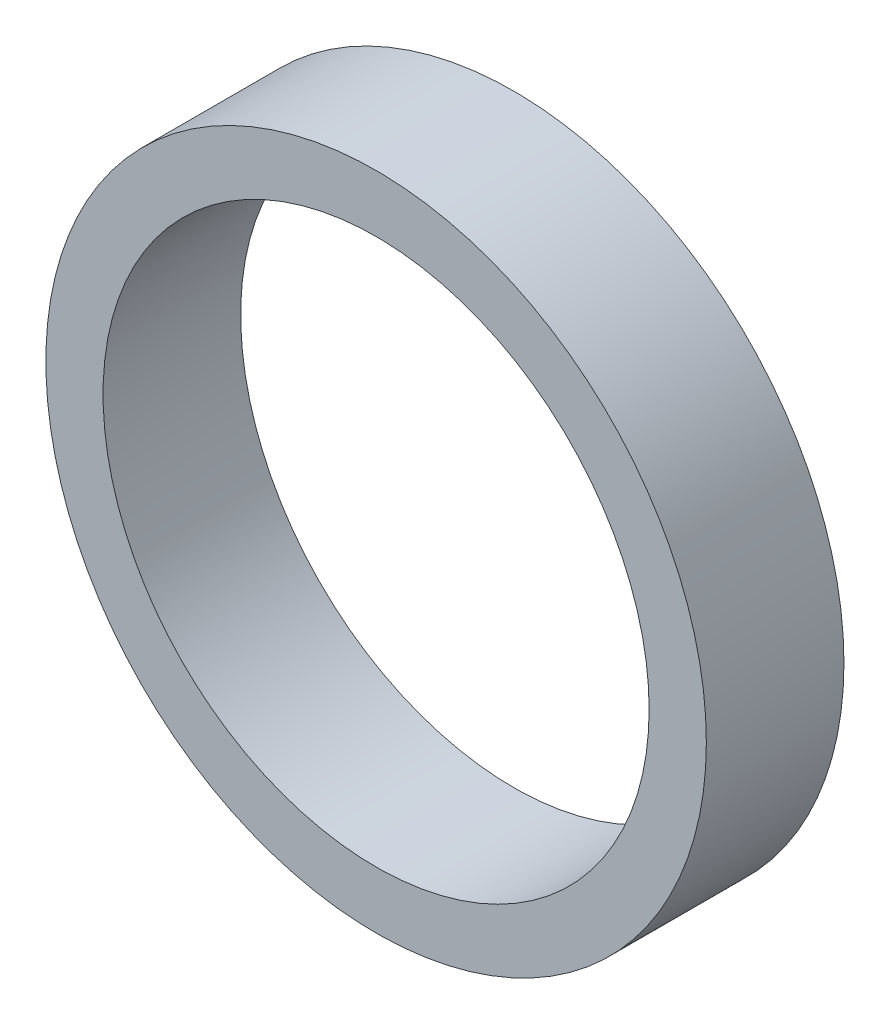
ISO-10303-21;
HEADER;
FILE_DESCRIPTION(('STEP AP214'),'2;1');
FILE_NAME('part.step','',(''),(''),'','','');
FILE_SCHEMA(('AUTOMOTIVE_DESIGN { 1 0 10303 214 1 1 1 1 }'));
ENDSEC;
DATA;
#1=APPLICATION_CONTEXT('core data for automotive mechanical design processes');
#2=APPLICATION_PROTOCOL_DEFINITION('international standard','automotive_design',2000,#1);
#3=PRODUCT_CONTEXT('',#1,'mechanical');
#4=PRODUCT('Part','Part','',(#3));
#5=PRODUCT_RELATED_PRODUCT_CATEGORY('part','',(#4));
#6=PRODUCT_DEFINITION_FORMATION('','',#4);
#7=PRODUCT_DEFINITION_CONTEXT('part definition',#1,'design');
#8=PRODUCT_DEFINITION('design','',#6,#7);
#9=PRODUCT_DEFINITION_SHAPE('','',#8);
#10=(LENGTH_UNIT() NAMED_UNIT(*) SI_UNIT(.MILLI.,.METRE.));
#11=(NAMED_UNIT(*) PLANE_ANGLE_UNIT() SI_UNIT($,.RADIAN.));
#12=(NAMED_UNIT(*) SI_UNIT($,.STERADIAN.) SOLID_ANGLE_UNIT());
#13=UNCERTAINTY_MEASURE_WITH_UNIT(LENGTH_MEASURE(1.E-05),#10,'distance_accuracy_value','');
#14=(GEOMETRIC_REPRESENTATION_CONTEXT(3) GLOBAL_UNCERTAINTY_ASSIGNED_CONTEXT((#13)) GLOBAL_UNIT_ASSIGNED_CONTEXT((#10,
#11,#12)) REPRESENTATION_CONTEXT('',''));
#15=CARTESIAN_POINT('',(0.,0.,0.));
#16=DIRECTION('',(0.,0.,1.));
#17=DIRECTION('',(1.,0.,0.));
#18=AXIS2_PLACEMENT_3D('',#15,#16,#17);
#19=CARTESIAN_POINT('',(0.,0.,3.175));
#20=DIRECTION('',(0.,0.,1.));
#21=DIRECTION('',(1.,0.,0.));
#22=AXIS2_PLACEMENT_3D('',#19,#20,#21);
#23=PLANE('',#22);
#24=CARTESIAN_POINT('',(0.,0.,3.175));
#25=DIRECTION('',(0.,0.,1.));
#26=DIRECTION('',(1.,0.,0.));
#27=AXIS2_PLACEMENT_3D('',#24,#25,#26);
#28=CIRCLE('',#27,7.62);
#29=CARTESIAN_POINT('',(7.62,0.,3.175));
#30=VERTEX_POINT('',#29);
#31=EDGE_CURVE('E10',#30,#30,#28,.T.);
#32=ORIENTED_EDGE('',*,*,#31,.T.);
#33=EDGE_LOOP('',(#32));
#34=FACE_BOUND('',#33,.T.);
#35=CARTESIAN_POINT('',(0.,0.,3.175));
#36=DIRECTION('',(0.,0.,1.));
#37=DIRECTION('',(1.,0.,0.));
#38=AXIS2_PLACEMENT_3D('',#35,#36,#37);
#39=CIRCLE('',#38,6.3);
#40=CARTESIAN_POINT('',(6.3,0.,3.175));
#41=VERTEX_POINT('',#40);
#42=EDGE_CURVE('E42',#41,#41,#39,.T.);
#43=ORIENTED_EDGE('',*,*,#42,.F.);
#44=EDGE_LOOP('',(#43));
#45=FACE_BOUND('',#44,.T.);
#46=ADVANCED_FACE('F31',(#34,#45),#23,.T.);
#47=CARTESIAN_POINT('',(0.,0.,0.));
#48=DIRECTION('',(0.,0.,1.));
#49=DIRECTION('',(1.,0.,0.));
#50=AXIS2_PLACEMENT_3D('',#47,#48,#49);
#51=PLANE('',#50);
#52=CARTESIAN_POINT('',(0.,0.,0.));
#53=DIRECTION('',(0.,0.,1.));
#54=DIRECTION('',(1.,0.,0.));
#55=AXIS2_PLACEMENT_3D('',#52,#53,#54);
#56=CIRCLE('',#55,7.62);
#57=CARTESIAN_POINT('',(7.62,0.,0.));
#58=VERTEX_POINT('',#57);
#59=EDGE_CURVE('E35',#58,#58,#56,.T.);
#60=ORIENTED_EDGE('',*,*,#59,.F.);
#61=EDGE_LOOP('',(#60));
#62=FACE_BOUND('',#61,.T.);
#63=CARTESIAN_POINT('',(0.,0.,0.));
#64=DIRECTION('',(0.,0.,1.));
#65=DIRECTION('',(1.,0.,0.));
#66=AXIS2_PLACEMENT_3D('',#63,#64,#65);
#67=CIRCLE('',#66,6.3);
#68=CARTESIAN_POINT('',(6.3,0.,0.));
#69=VERTEX_POINT('',#68);
#70=EDGE_CURVE('E44',#69,#69,#67,.T.);
#71=ORIENTED_EDGE('',*,*,#70,.T.);
#72=EDGE_LOOP('',(#71));
#73=FACE_BOUND('',#72,.T.);
#74=ADVANCED_FACE('F54',(#62,#73),#51,.F.);
#75=CARTESIAN_POINT('',(0.,0.,3.175));
#76=DIRECTION('',(0.,0.,-1.));
#77=DIRECTION('',(-1.,0.,0.));
#78=AXIS2_PLACEMENT_3D('',#75,#76,#77);
#79=CYLINDRICAL_SURFACE('',#78,7.62);
#80=ORIENTED_EDGE('',*,*,#31,.F.);
#81=EDGE_LOOP('',(#80));
#82=FACE_BOUND('',#81,.T.);
#83=ORIENTED_EDGE('',*,*,#59,.T.);
#84=EDGE_LOOP('',(#83));
#85=FACE_BOUND('',#84,.T.);
#86=ADVANCED_FACE('F33',(#82,#85),#79,.T.);
#87=CARTESIAN_POINT('',(0.,0.,3.175));
#88=DIRECTION('',(0.,0.,-1.));
#89=DIRECTION('',(-1.,0.,0.));
#90=AXIS2_PLACEMENT_3D('',#87,#88,#89);
#91=CYLINDRICAL_SURFACE('',#90,6.3);
#92=ORIENTED_EDGE('',*,*,#42,.T.);
#93=EDGE_LOOP('',(#92));
#94=FACE_BOUND('',#93,.T.);
#95=ORIENTED_EDGE('',*,*,#70,.F.);
#96=EDGE_LOOP('',(#95));
#97=FACE_BOUND('',#96,.T.);
#98=ADVANCED_FACE('F50',(#94,#97),#91,.F.);
#99=CLOSED_SHELL('',(#46,#74,#86,#98));
#100=MANIFOLD_SOLID_BREP('B2',#99);
#101=ADVANCED_BREP_SHAPE_REPRESENTATION('',(#18,#100),#14);
#102=SHAPE_DEFINITION_REPRESENTATION(#9,#101);
ENDSEC;
END-ISO-10303-21;
